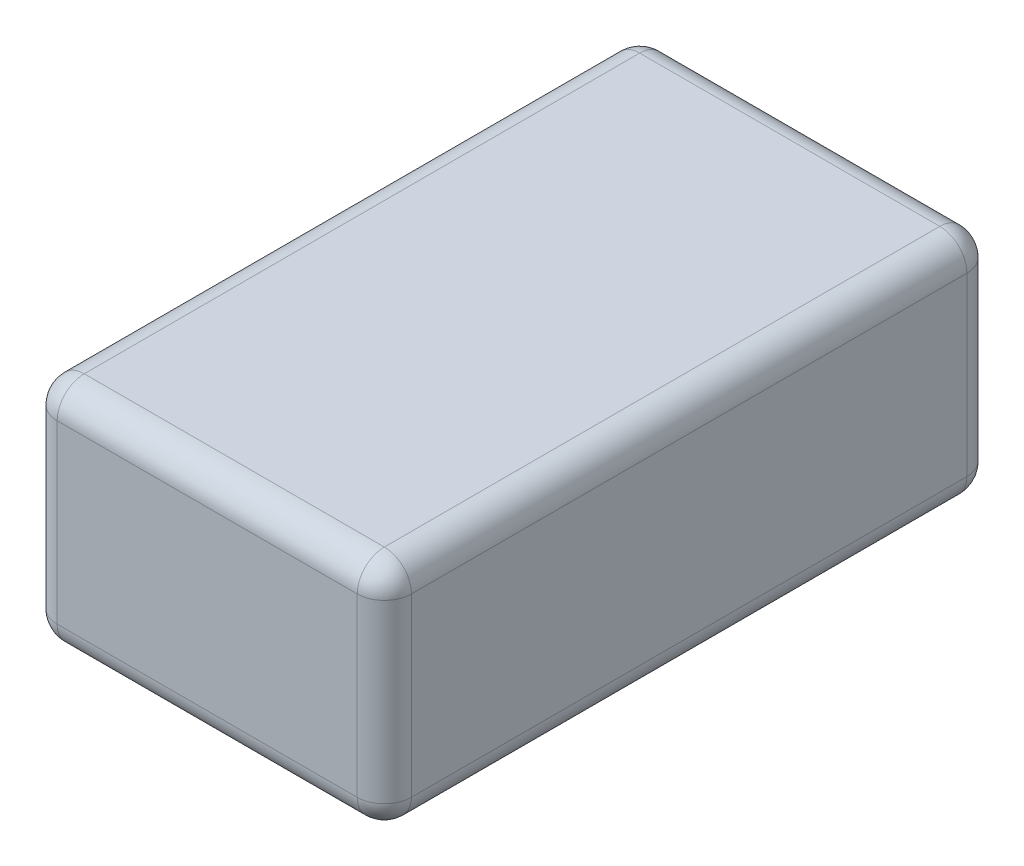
ISO-10303-21;
HEADER;
FILE_DESCRIPTION(('STEP AP214'),'2;1');
FILE_NAME('part.step','',(''),(''),'','','');
FILE_SCHEMA(('AUTOMOTIVE_DESIGN { 1 0 10303 214 1 1 1 1 }'));
ENDSEC;
DATA;
#1=APPLICATION_CONTEXT('core data for automotive mechanical design processes');
#2=APPLICATION_PROTOCOL_DEFINITION('international standard','automotive_design',2000,#1);
#3=PRODUCT_CONTEXT('',#1,'mechanical');
#4=PRODUCT('Part','Part','',(#3));
#5=PRODUCT_RELATED_PRODUCT_CATEGORY('part','',(#4));
#6=PRODUCT_DEFINITION_FORMATION('','',#4);
#7=PRODUCT_DEFINITION_CONTEXT('part definition',#1,'design');
#8=PRODUCT_DEFINITION('design','',#6,#7);
#9=PRODUCT_DEFINITION_SHAPE('','',#8);
#10=(LENGTH_UNIT() NAMED_UNIT(*) SI_UNIT(.MILLI.,.METRE.));
#11=(NAMED_UNIT(*) PLANE_ANGLE_UNIT() SI_UNIT($,.RADIAN.));
#12=(NAMED_UNIT(*) SI_UNIT($,.STERADIAN.) SOLID_ANGLE_UNIT());
#13=UNCERTAINTY_MEASURE_WITH_UNIT(LENGTH_MEASURE(1.E-05),#10,'distance_accuracy_value','');
#14=(GEOMETRIC_REPRESENTATION_CONTEXT(3) GLOBAL_UNCERTAINTY_ASSIGNED_CONTEXT((#13)) GLOBAL_UNIT_ASSIGNED_CONTEXT((#10,
#11,#12)) REPRESENTATION_CONTEXT('',''));
#15=CARTESIAN_POINT('',(0.,0.,0.));
#16=DIRECTION('',(0.,0.,1.));
#17=DIRECTION('',(1.,0.,0.));
#18=AXIS2_PLACEMENT_3D('',#15,#16,#17);
#19=CARTESIAN_POINT('',(13.075,17.,-22.5));
#20=DIRECTION('',(-1.,0.,0.));
#21=DIRECTION('',(0.,0.,1.));
#22=AXIS2_PLACEMENT_3D('',#19,#20,#21);
#23=PLANE('',#22);
#24=DIRECTION('',(0.,0.,-1.));
#25=VECTOR('',#24,1.);
#26=CARTESIAN_POINT('',(13.075,2.,-22.5));
#27=LINE('',#26,#25);
#28=CARTESIAN_POINT('',(13.075,2.,20.5));
#29=VERTEX_POINT('',#28);
#30=CARTESIAN_POINT('',(13.075,2.,-20.5));
#31=VERTEX_POINT('',#30);
#32=EDGE_CURVE('E216',#29,#31,#27,.T.);
#33=ORIENTED_EDGE('',*,*,#32,.T.);
#34=DIRECTION('',(0.,-1.,0.));
#35=VECTOR('',#34,1.);
#36=CARTESIAN_POINT('',(13.075,17.,-20.5));
#37=LINE('',#36,#35);
#38=CARTESIAN_POINT('',(13.075,15.,-20.5));
#39=VERTEX_POINT('',#38);
#40=EDGE_CURVE('E214',#31,#39,#37,.F.);
#41=ORIENTED_EDGE('',*,*,#40,.T.);
#42=DIRECTION('',(0.,0.,-1.));
#43=VECTOR('',#42,1.);
#44=CARTESIAN_POINT('',(13.075,15.,22.5));
#45=LINE('',#44,#43);
#46=CARTESIAN_POINT('',(13.075,15.,20.5));
#47=VERTEX_POINT('',#46);
#48=EDGE_CURVE('E207',#39,#47,#45,.F.);
#49=ORIENTED_EDGE('',*,*,#48,.T.);
#50=DIRECTION('',(0.,-1.,0.));
#51=VECTOR('',#50,1.);
#52=CARTESIAN_POINT('',(13.075,17.,20.5));
#53=LINE('',#52,#51);
#54=EDGE_CURVE('E210',#47,#29,#53,.T.);
#55=ORIENTED_EDGE('',*,*,#54,.T.);
#56=EDGE_LOOP('',(#33,#41,#49,#55));
#57=FACE_BOUND('',#56,.T.);
#58=ADVANCED_FACE('F33',(#57),#23,.F.);
#59=CARTESIAN_POINT('',(-13.075,17.,-22.5));
#60=DIRECTION('',(0.,0.,1.));
#61=DIRECTION('',(1.,0.,0.));
#62=AXIS2_PLACEMENT_3D('',#59,#60,#61);
#63=PLANE('',#62);
#64=CARTESIAN_POINT('',(5.99999999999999,8.5,-22.5));
#65=DIRECTION('',(0.,0.,1.));
#66=DIRECTION('',(1.,0.,0.));
#67=AXIS2_PLACEMENT_3D('',#64,#65,#66);
#68=CIRCLE('',#67,3.);
#69=CARTESIAN_POINT('',(8.99999999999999,8.5,-22.5));
#70=VERTEX_POINT('',#69);
#71=EDGE_CURVE('E309',#70,#70,#68,.T.);
#72=ORIENTED_EDGE('',*,*,#71,.T.);
#73=EDGE_LOOP('',(#72));
#74=FACE_BOUND('',#73,.T.);
#75=CARTESIAN_POINT('',(-6.00000000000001,8.5,-22.5));
#76=DIRECTION('',(0.,0.,1.));
#77=DIRECTION('',(1.,0.,0.));
#78=AXIS2_PLACEMENT_3D('',#75,#76,#77);
#79=CIRCLE('',#78,4.);
#80=CARTESIAN_POINT('',(-2.00000000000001,8.5,-22.5));
#81=VERTEX_POINT('',#80);
#82=EDGE_CURVE('E303',#81,#81,#79,.T.);
#83=ORIENTED_EDGE('',*,*,#82,.T.);
#84=EDGE_LOOP('',(#83));
#85=FACE_BOUND('',#84,.T.);
#86=DIRECTION('',(-1.,0.,0.));
#87=VECTOR('',#86,1.);
#88=CARTESIAN_POINT('',(-13.075,2.,-22.5));
#89=LINE('',#88,#87);
#90=CARTESIAN_POINT('',(11.075,2.,-22.5));
#91=VERTEX_POINT('',#90);
#92=CARTESIAN_POINT('',(-11.075,2.,-22.5));
#93=VERTEX_POINT('',#92);
#94=EDGE_CURVE('E273',#91,#93,#89,.T.);
#95=ORIENTED_EDGE('',*,*,#94,.T.);
#96=DIRECTION('',(0.,-1.,0.));
#97=VECTOR('',#96,1.);
#98=CARTESIAN_POINT('',(-11.075,17.,-22.5));
#99=LINE('',#98,#97);
#100=CARTESIAN_POINT('',(-11.075,15.,-22.5));
#101=VERTEX_POINT('',#100);
#102=EDGE_CURVE('E275',#93,#101,#99,.F.);
#103=ORIENTED_EDGE('',*,*,#102,.T.);
#104=DIRECTION('',(-1.,0.,0.));
#105=VECTOR('',#104,1.);
#106=CARTESIAN_POINT('',(13.075,15.,-22.5));
#107=LINE('',#106,#105);
#108=CARTESIAN_POINT('',(11.075,15.,-22.5));
#109=VERTEX_POINT('',#108);
#110=EDGE_CURVE('E266',#101,#109,#107,.F.);
#111=ORIENTED_EDGE('',*,*,#110,.T.);
#112=DIRECTION('',(0.,-1.,0.));
#113=VECTOR('',#112,1.);
#114=CARTESIAN_POINT('',(11.075,17.,-22.5));
#115=LINE('',#114,#113);
#116=EDGE_CURVE('E268',#109,#91,#115,.T.);
#117=ORIENTED_EDGE('',*,*,#116,.T.);
#118=EDGE_LOOP('',(#95,#103,#111,#117));
#119=FACE_BOUND('',#118,.T.);
#120=ADVANCED_FACE('F327',(#74,#85,#119),#63,.F.);
#121=CARTESIAN_POINT('',(-13.075,17.,-22.5));
#122=DIRECTION('',(1.,0.,0.));
#123=DIRECTION('',(0.,0.,-1.));
#124=AXIS2_PLACEMENT_3D('',#121,#122,#123);
#125=PLANE('',#124);
#126=DIRECTION('',(0.,-1.,0.));
#127=VECTOR('',#126,1.);
#128=CARTESIAN_POINT('',(-13.075,17.,-20.5));
#129=LINE('',#128,#127);
#130=CARTESIAN_POINT('',(-13.075,15.,-20.5));
#131=VERTEX_POINT('',#130);
#132=CARTESIAN_POINT('',(-13.075,2.,-20.5));
#133=VERTEX_POINT('',#132);
#134=EDGE_CURVE('E134',#131,#133,#129,.T.);
#135=ORIENTED_EDGE('',*,*,#134,.T.);
#136=DIRECTION('',(0.,0.,1.));
#137=VECTOR('',#136,1.);
#138=CARTESIAN_POINT('',(-13.075,2.,-22.5));
#139=LINE('',#138,#137);
#140=CARTESIAN_POINT('',(-13.075,2.,20.5));
#141=VERTEX_POINT('',#140);
#142=EDGE_CURVE('E130',#133,#141,#139,.T.);
#143=ORIENTED_EDGE('',*,*,#142,.T.);
#144=DIRECTION('',(0.,-1.,0.));
#145=VECTOR('',#144,1.);
#146=CARTESIAN_POINT('',(-13.075,17.,20.5));
#147=LINE('',#146,#145);
#148=CARTESIAN_POINT('',(-13.075,15.,20.5));
#149=VERTEX_POINT('',#148);
#150=EDGE_CURVE('E125',#141,#149,#147,.F.);
#151=ORIENTED_EDGE('',*,*,#150,.T.);
#152=DIRECTION('',(0.,0.,1.));
#153=VECTOR('',#152,1.);
#154=CARTESIAN_POINT('',(-13.075,15.,-22.5));
#155=LINE('',#154,#153);
#156=EDGE_CURVE('E128',#149,#131,#155,.F.);
#157=ORIENTED_EDGE('',*,*,#156,.T.);
#158=EDGE_LOOP('',(#135,#143,#151,#157));
#159=FACE_BOUND('',#158,.T.);
#160=ADVANCED_FACE('F127',(#159),#125,.F.);
#161=CARTESIAN_POINT('',(-13.075,17.,22.5));
#162=DIRECTION('',(0.,0.,-1.));
#163=DIRECTION('',(-1.,0.,0.));
#164=AXIS2_PLACEMENT_3D('',#161,#162,#163);
#165=PLANE('',#164);
#166=DIRECTION('',(0.,-1.,0.));
#167=VECTOR('',#166,1.);
#168=CARTESIAN_POINT('',(-11.075,17.,22.5));
#169=LINE('',#168,#167);
#170=CARTESIAN_POINT('',(-11.075,15.,22.5));
#171=VERTEX_POINT('',#170);
#172=CARTESIAN_POINT('',(-11.075,2.,22.5));
#173=VERTEX_POINT('',#172);
#174=EDGE_CURVE('E152',#171,#173,#169,.T.);
#175=ORIENTED_EDGE('',*,*,#174,.T.);
#176=DIRECTION('',(1.,0.,0.));
#177=VECTOR('',#176,1.);
#178=CARTESIAN_POINT('',(-13.075,2.,22.5));
#179=LINE('',#178,#177);
#180=CARTESIAN_POINT('',(11.075,2.,22.5));
#181=VERTEX_POINT('',#180);
#182=EDGE_CURVE('E211',#173,#181,#179,.T.);
#183=ORIENTED_EDGE('',*,*,#182,.T.);
#184=DIRECTION('',(0.,-1.,0.));
#185=VECTOR('',#184,1.);
#186=CARTESIAN_POINT('',(11.075,17.,22.5));
#187=LINE('',#186,#185);
#188=CARTESIAN_POINT('',(11.075,15.,22.5));
#189=VERTEX_POINT('',#188);
#190=EDGE_CURVE('E278',#181,#189,#187,.F.);
#191=ORIENTED_EDGE('',*,*,#190,.T.);
#192=DIRECTION('',(1.,0.,0.));
#193=VECTOR('',#192,1.);
#194=CARTESIAN_POINT('',(-13.075,15.,22.5));
#195=LINE('',#194,#193);
#196=EDGE_CURVE('E280',#189,#171,#195,.F.);
#197=ORIENTED_EDGE('',*,*,#196,.T.);
#198=EDGE_LOOP('',(#175,#183,#191,#197));
#199=FACE_BOUND('',#198,.T.);
#200=ADVANCED_FACE('F398',(#199),#165,.F.);
#201=CARTESIAN_POINT('',(0.,17.,0.));
#202=DIRECTION('',(0.,1.,0.));
#203=DIRECTION('',(0.,0.,1.));
#204=AXIS2_PLACEMENT_3D('',#201,#202,#203);
#205=PLANE('',#204);
#206=DIRECTION('',(0.,0.,-1.));
#207=VECTOR('',#206,1.);
#208=CARTESIAN_POINT('',(11.075,17.,-22.5));
#209=LINE('',#208,#207);
#210=CARTESIAN_POINT('',(11.075,17.,20.5));
#211=VERTEX_POINT('',#210);
#212=CARTESIAN_POINT('',(11.075,17.,-20.5));
#213=VERTEX_POINT('',#212);
#214=EDGE_CURVE('E220',#211,#213,#209,.T.);
#215=ORIENTED_EDGE('',*,*,#214,.T.);
#216=DIRECTION('',(-1.,0.,0.));
#217=VECTOR('',#216,1.);
#218=CARTESIAN_POINT('',(-13.075,17.,-20.5));
#219=LINE('',#218,#217);
#220=CARTESIAN_POINT('',(-11.075,17.,-20.5));
#221=VERTEX_POINT('',#220);
#222=EDGE_CURVE('E11',#213,#221,#219,.T.);
#223=ORIENTED_EDGE('',*,*,#222,.T.);
#224=DIRECTION('',(0.,0.,1.));
#225=VECTOR('',#224,1.);
#226=CARTESIAN_POINT('',(-11.075,17.,22.5));
#227=LINE('',#226,#225);
#228=CARTESIAN_POINT('',(-11.075,17.,20.5));
#229=VERTEX_POINT('',#228);
#230=EDGE_CURVE('E42',#221,#229,#227,.T.);
#231=ORIENTED_EDGE('',*,*,#230,.T.);
#232=DIRECTION('',(1.,0.,0.));
#233=VECTOR('',#232,1.);
#234=CARTESIAN_POINT('',(13.075,17.,20.5));
#235=LINE('',#234,#233);
#236=EDGE_CURVE('E222',#229,#211,#235,.T.);
#237=ORIENTED_EDGE('',*,*,#236,.T.);
#238=EDGE_LOOP('',(#215,#223,#231,#237));
#239=FACE_BOUND('',#238,.T.);
#240=ADVANCED_FACE('F393',(#239),#205,.T.);
#241=CARTESIAN_POINT('',(0.,0.,0.));
#242=DIRECTION('',(0.,1.,0.));
#243=DIRECTION('',(0.,0.,1.));
#244=AXIS2_PLACEMENT_3D('',#241,#242,#243);
#245=PLANE('',#244);
#246=DIRECTION('',(1.,0.,0.));
#247=VECTOR('',#246,1.);
#248=CARTESIAN_POINT('',(0.,0.,20.5));
#249=LINE('',#248,#247);
#250=CARTESIAN_POINT('',(11.075,0.,20.5));
#251=VERTEX_POINT('',#250);
#252=CARTESIAN_POINT('',(-11.075,0.,20.5));
#253=VERTEX_POINT('',#252);
#254=EDGE_CURVE('E258',#251,#253,#249,.F.);
#255=ORIENTED_EDGE('',*,*,#254,.T.);
#256=DIRECTION('',(0.,0.,1.));
#257=VECTOR('',#256,1.);
#258=CARTESIAN_POINT('',(-11.075,0.,0.));
#259=LINE('',#258,#257);
#260=CARTESIAN_POINT('',(-11.075,0.,-20.5));
#261=VERTEX_POINT('',#260);
#262=EDGE_CURVE('E257',#253,#261,#259,.F.);
#263=ORIENTED_EDGE('',*,*,#262,.T.);
#264=DIRECTION('',(-1.,0.,0.));
#265=VECTOR('',#264,1.);
#266=CARTESIAN_POINT('',(0.,0.,-20.5));
#267=LINE('',#266,#265);
#268=CARTESIAN_POINT('',(11.075,0.,-20.5));
#269=VERTEX_POINT('',#268);
#270=EDGE_CURVE('E251',#261,#269,#267,.F.);
#271=ORIENTED_EDGE('',*,*,#270,.T.);
#272=DIRECTION('',(0.,0.,-1.));
#273=VECTOR('',#272,1.);
#274=CARTESIAN_POINT('',(11.075,0.,0.));
#275=LINE('',#274,#273);
#276=EDGE_CURVE('E298',#269,#251,#275,.F.);
#277=ORIENTED_EDGE('',*,*,#276,.T.);
#278=EDGE_LOOP('',(#255,#263,#271,#277));
#279=FACE_BOUND('',#278,.T.);
#280=ADVANCED_FACE('F261',(#279),#245,.F.);
#281=CARTESIAN_POINT('',(11.075,15.,0.));
#282=DIRECTION('',(0.,0.,1.));
#283=DIRECTION('',(1.,0.,0.));
#284=AXIS2_PLACEMENT_3D('',#281,#282,#283);
#285=CYLINDRICAL_SURFACE('',#284,2.);
#286=CARTESIAN_POINT('',(11.075,15.,-20.5));
#287=DIRECTION('',(0.,0.,-1.));
#288=DIRECTION('',(-1.,0.,0.));
#289=AXIS2_PLACEMENT_3D('',#286,#287,#288);
#290=CIRCLE('',#289,2.);
#291=EDGE_CURVE('E37',#213,#39,#290,.T.);
#292=ORIENTED_EDGE('',*,*,#291,.F.);
#293=ORIENTED_EDGE('',*,*,#214,.F.);
#294=CARTESIAN_POINT('',(11.075,15.,20.5));
#295=DIRECTION('',(0.,0.,1.));
#296=DIRECTION('',(1.,0.,0.));
#297=AXIS2_PLACEMENT_3D('',#294,#295,#296);
#298=CIRCLE('',#297,2.);
#299=EDGE_CURVE('E190',#47,#211,#298,.T.);
#300=ORIENTED_EDGE('',*,*,#299,.F.);
#301=ORIENTED_EDGE('',*,*,#48,.F.);
#302=EDGE_LOOP('',(#292,#293,#300,#301));
#303=FACE_BOUND('',#302,.T.);
#304=ADVANCED_FACE('F35',(#303),#285,.T.);
#305=CARTESIAN_POINT('',(11.075,15.,-20.5));
#306=DIRECTION('',(0.,0.,1.));
#307=DIRECTION('',(1.,0.,0.));
#308=AXIS2_PLACEMENT_3D('',#305,#306,#307);
#309=SPHERICAL_SURFACE('',#308,2.);
#310=CARTESIAN_POINT('',(11.075,15.,-20.5));
#311=DIRECTION('',(1.,0.,0.));
#312=DIRECTION('',(0.,1.,0.));
#313=AXIS2_PLACEMENT_3D('',#310,#311,#312);
#314=CIRCLE('',#313,2.);
#315=EDGE_CURVE('E186',#213,#109,#314,.F.);
#316=ORIENTED_EDGE('',*,*,#315,.F.);
#317=ORIENTED_EDGE('',*,*,#291,.T.);
#318=CARTESIAN_POINT('',(11.075,15.,-20.5));
#319=DIRECTION('',(0.,1.,0.));
#320=DIRECTION('',(0.,0.,1.));
#321=AXIS2_PLACEMENT_3D('',#318,#319,#320);
#322=CIRCLE('',#321,2.);
#323=EDGE_CURVE('E189',#109,#39,#322,.F.);
#324=ORIENTED_EDGE('',*,*,#323,.F.);
#325=EDGE_LOOP('',(#316,#317,#324));
#326=FACE_BOUND('',#325,.T.);
#327=ADVANCED_FACE('F202',(#326),#309,.T.);
#328=CARTESIAN_POINT('',(11.075,15.,20.5));
#329=DIRECTION('',(0.,0.,1.));
#330=DIRECTION('',(1.,0.,0.));
#331=AXIS2_PLACEMENT_3D('',#328,#329,#330);
#332=SPHERICAL_SURFACE('',#331,2.);
#333=CARTESIAN_POINT('',(11.075,15.,20.5));
#334=DIRECTION('',(0.,1.,0.));
#335=DIRECTION('',(0.,0.,1.));
#336=AXIS2_PLACEMENT_3D('',#333,#334,#335);
#337=CIRCLE('',#336,2.);
#338=EDGE_CURVE('E180',#47,#189,#337,.F.);
#339=ORIENTED_EDGE('',*,*,#338,.F.);
#340=ORIENTED_EDGE('',*,*,#299,.T.);
#341=CARTESIAN_POINT('',(11.075,15.,20.5));
#342=DIRECTION('',(1.,0.,0.));
#343=DIRECTION('',(0.,0.,-1.));
#344=AXIS2_PLACEMENT_3D('',#341,#342,#343);
#345=CIRCLE('',#344,2.);
#346=EDGE_CURVE('E183',#189,#211,#345,.F.);
#347=ORIENTED_EDGE('',*,*,#346,.F.);
#348=EDGE_LOOP('',(#339,#340,#347));
#349=FACE_BOUND('',#348,.T.);
#350=ADVANCED_FACE('F384',(#349),#332,.T.);
#351=CARTESIAN_POINT('',(11.075,17.,-20.5));
#352=DIRECTION('',(0.,-1.,0.));
#353=DIRECTION('',(0.,0.,-1.));
#354=AXIS2_PLACEMENT_3D('',#351,#352,#353);
#355=CYLINDRICAL_SURFACE('',#354,2.);
#356=ORIENTED_EDGE('',*,*,#323,.T.);
#357=ORIENTED_EDGE('',*,*,#40,.F.);
#358=CARTESIAN_POINT('',(11.075,2.,-20.5));
#359=DIRECTION('',(0.,-1.,0.));
#360=DIRECTION('',(0.,0.,-1.));
#361=AXIS2_PLACEMENT_3D('',#358,#359,#360);
#362=CIRCLE('',#361,2.);
#363=EDGE_CURVE('E174',#91,#31,#362,.T.);
#364=ORIENTED_EDGE('',*,*,#363,.F.);
#365=ORIENTED_EDGE('',*,*,#116,.F.);
#366=EDGE_LOOP('',(#356,#357,#364,#365));
#367=FACE_BOUND('',#366,.T.);
#368=ADVANCED_FACE('F380',(#367),#355,.T.);
#369=CARTESIAN_POINT('',(0.,15.,-20.5));
#370=DIRECTION('',(1.,0.,0.));
#371=DIRECTION('',(0.,0.,-1.));
#372=AXIS2_PLACEMENT_3D('',#369,#370,#371);
#373=CYLINDRICAL_SURFACE('',#372,2.);
#374=ORIENTED_EDGE('',*,*,#315,.T.);
#375=ORIENTED_EDGE('',*,*,#110,.F.);
#376=CARTESIAN_POINT('',(-11.075,15.,-20.5));
#377=DIRECTION('',(-1.,0.,0.));
#378=DIRECTION('',(0.,0.,1.));
#379=AXIS2_PLACEMENT_3D('',#376,#377,#378);
#380=CIRCLE('',#379,2.);
#381=EDGE_CURVE('E172',#221,#101,#380,.T.);
#382=ORIENTED_EDGE('',*,*,#381,.F.);
#383=ORIENTED_EDGE('',*,*,#222,.F.);
#384=EDGE_LOOP('',(#374,#375,#382,#383));
#385=FACE_BOUND('',#384,.T.);
#386=ADVANCED_FACE('F377',(#385),#373,.T.);
#387=CARTESIAN_POINT('',(-11.075,15.,0.));
#388=DIRECTION('',(0.,0.,-1.));
#389=DIRECTION('',(-1.,0.,0.));
#390=AXIS2_PLACEMENT_3D('',#387,#388,#389);
#391=CYLINDRICAL_SURFACE('',#390,2.);
#392=CARTESIAN_POINT('',(-11.075,15.,20.5));
#393=DIRECTION('',(0.,0.,1.));
#394=DIRECTION('',(1.,0.,0.));
#395=AXIS2_PLACEMENT_3D('',#392,#393,#394);
#396=CIRCLE('',#395,2.);
#397=EDGE_CURVE('E140',#229,#149,#396,.T.);
#398=ORIENTED_EDGE('',*,*,#397,.F.);
#399=ORIENTED_EDGE('',*,*,#230,.F.);
#400=CARTESIAN_POINT('',(-11.075,15.,-20.5));
#401=DIRECTION('',(0.,0.,-1.));
#402=DIRECTION('',(-1.,0.,0.));
#403=AXIS2_PLACEMENT_3D('',#400,#401,#402);
#404=CIRCLE('',#403,2.);
#405=EDGE_CURVE('E50',#131,#221,#404,.T.);
#406=ORIENTED_EDGE('',*,*,#405,.F.);
#407=ORIENTED_EDGE('',*,*,#156,.F.);
#408=EDGE_LOOP('',(#398,#399,#406,#407));
#409=FACE_BOUND('',#408,.T.);
#410=ADVANCED_FACE('F139',(#409),#391,.T.);
#411=CARTESIAN_POINT('',(0.,15.,20.5));
#412=DIRECTION('',(-1.,0.,0.));
#413=DIRECTION('',(0.,0.,1.));
#414=AXIS2_PLACEMENT_3D('',#411,#412,#413);
#415=CYLINDRICAL_SURFACE('',#414,2.);
#416=ORIENTED_EDGE('',*,*,#346,.T.);
#417=ORIENTED_EDGE('',*,*,#236,.F.);
#418=CARTESIAN_POINT('',(-11.075,15.,20.5));
#419=DIRECTION('',(-1.,0.,0.));
#420=DIRECTION('',(0.,0.,1.));
#421=AXIS2_PLACEMENT_3D('',#418,#419,#420);
#422=CIRCLE('',#421,2.);
#423=EDGE_CURVE('E149',#171,#229,#422,.T.);
#424=ORIENTED_EDGE('',*,*,#423,.F.);
#425=ORIENTED_EDGE('',*,*,#196,.F.);
#426=EDGE_LOOP('',(#416,#417,#424,#425));
#427=FACE_BOUND('',#426,.T.);
#428=ADVANCED_FACE('F371',(#427),#415,.T.);
#429=CARTESIAN_POINT('',(11.075,17.,20.5));
#430=DIRECTION('',(0.,-1.,0.));
#431=DIRECTION('',(0.,0.,-1.));
#432=AXIS2_PLACEMENT_3D('',#429,#430,#431);
#433=CYLINDRICAL_SURFACE('',#432,2.);
#434=ORIENTED_EDGE('',*,*,#338,.T.);
#435=ORIENTED_EDGE('',*,*,#190,.F.);
#436=CARTESIAN_POINT('',(11.075,2.,20.5));
#437=DIRECTION('',(0.,-1.,0.));
#438=DIRECTION('',(0.,0.,-1.));
#439=AXIS2_PLACEMENT_3D('',#436,#437,#438);
#440=CIRCLE('',#439,2.);
#441=EDGE_CURVE('E167',#29,#181,#440,.T.);
#442=ORIENTED_EDGE('',*,*,#441,.F.);
#443=ORIENTED_EDGE('',*,*,#54,.F.);
#444=EDGE_LOOP('',(#434,#435,#442,#443));
#445=FACE_BOUND('',#444,.T.);
#446=ADVANCED_FACE('F292',(#445),#433,.T.);
#447=CARTESIAN_POINT('',(11.075,2.,-22.5));
#448=DIRECTION('',(0.,0.,-1.));
#449=DIRECTION('',(-1.,0.,0.));
#450=AXIS2_PLACEMENT_3D('',#447,#448,#449);
#451=CYLINDRICAL_SURFACE('',#450,2.);
#452=CARTESIAN_POINT('',(11.075,2.,-20.5));
#453=DIRECTION('',(0.,0.,-1.));
#454=DIRECTION('',(-1.,0.,0.));
#455=AXIS2_PLACEMENT_3D('',#452,#453,#454);
#456=CIRCLE('',#455,2.);
#457=EDGE_CURVE('E177',#31,#269,#456,.T.);
#458=ORIENTED_EDGE('',*,*,#457,.F.);
#459=ORIENTED_EDGE('',*,*,#32,.F.);
#460=CARTESIAN_POINT('',(11.075,2.,20.5));
#461=DIRECTION('',(0.,0.,1.));
#462=DIRECTION('',(1.,0.,0.));
#463=AXIS2_PLACEMENT_3D('',#460,#461,#462);
#464=CIRCLE('',#463,2.);
#465=EDGE_CURVE('E164',#251,#29,#464,.T.);
#466=ORIENTED_EDGE('',*,*,#465,.F.);
#467=ORIENTED_EDGE('',*,*,#276,.F.);
#468=EDGE_LOOP('',(#458,#459,#466,#467));
#469=FACE_BOUND('',#468,.T.);
#470=ADVANCED_FACE('F289',(#469),#451,.T.);
#471=CARTESIAN_POINT('',(11.075,2.,-20.5));
#472=DIRECTION('',(0.,0.,1.));
#473=DIRECTION('',(1.,0.,0.));
#474=AXIS2_PLACEMENT_3D('',#471,#472,#473);
#475=SPHERICAL_SURFACE('',#474,2.);
#476=ORIENTED_EDGE('',*,*,#363,.T.);
#477=ORIENTED_EDGE('',*,*,#457,.T.);
#478=CARTESIAN_POINT('',(11.075,2.,-20.5));
#479=DIRECTION('',(1.,0.,0.));
#480=DIRECTION('',(0.,0.,-1.));
#481=AXIS2_PLACEMENT_3D('',#478,#479,#480);
#482=CIRCLE('',#481,2.);
#483=EDGE_CURVE('E156',#91,#269,#482,.F.);
#484=ORIENTED_EDGE('',*,*,#483,.F.);
#485=EDGE_LOOP('',(#476,#477,#484));
#486=FACE_BOUND('',#485,.T.);
#487=ADVANCED_FACE('F363',(#486),#475,.T.);
#488=CARTESIAN_POINT('',(-11.075,15.,-20.5));
#489=DIRECTION('',(0.,0.,1.));
#490=DIRECTION('',(1.,0.,0.));
#491=AXIS2_PLACEMENT_3D('',#488,#489,#490);
#492=SPHERICAL_SURFACE('',#491,2.);
#493=ORIENTED_EDGE('',*,*,#405,.T.);
#494=ORIENTED_EDGE('',*,*,#381,.T.);
#495=CARTESIAN_POINT('',(-11.075,15.,-20.5));
#496=DIRECTION('',(0.,1.,0.));
#497=DIRECTION('',(0.,0.,1.));
#498=AXIS2_PLACEMENT_3D('',#495,#496,#497);
#499=CIRCLE('',#498,2.);
#500=EDGE_CURVE('E153',#131,#101,#499,.F.);
#501=ORIENTED_EDGE('',*,*,#500,.F.);
#502=EDGE_LOOP('',(#493,#494,#501));
#503=FACE_BOUND('',#502,.T.);
#504=ADVANCED_FACE('F360',(#503),#492,.T.);
#505=CARTESIAN_POINT('',(-11.075,15.,20.5));
#506=DIRECTION('',(0.,0.,1.));
#507=DIRECTION('',(1.,0.,0.));
#508=AXIS2_PLACEMENT_3D('',#505,#506,#507);
#509=SPHERICAL_SURFACE('',#508,2.);
#510=ORIENTED_EDGE('',*,*,#423,.T.);
#511=ORIENTED_EDGE('',*,*,#397,.T.);
#512=CARTESIAN_POINT('',(-11.075,15.,20.5));
#513=DIRECTION('',(0.,1.,0.));
#514=DIRECTION('',(0.,0.,1.));
#515=AXIS2_PLACEMENT_3D('',#512,#513,#514);
#516=CIRCLE('',#515,2.);
#517=EDGE_CURVE('E146',#171,#149,#516,.F.);
#518=ORIENTED_EDGE('',*,*,#517,.F.);
#519=EDGE_LOOP('',(#510,#511,#518));
#520=FACE_BOUND('',#519,.T.);
#521=ADVANCED_FACE('F145',(#520),#509,.T.);
#522=CARTESIAN_POINT('',(11.075,2.,20.5));
#523=DIRECTION('',(0.,0.,1.));
#524=DIRECTION('',(1.,0.,0.));
#525=AXIS2_PLACEMENT_3D('',#522,#523,#524);
#526=SPHERICAL_SURFACE('',#525,2.);
#527=ORIENTED_EDGE('',*,*,#465,.T.);
#528=ORIENTED_EDGE('',*,*,#441,.T.);
#529=CARTESIAN_POINT('',(11.075,2.,20.5));
#530=DIRECTION('',(1.,0.,0.));
#531=DIRECTION('',(0.,0.,-1.));
#532=AXIS2_PLACEMENT_3D('',#529,#530,#531);
#533=CIRCLE('',#532,2.);
#534=EDGE_CURVE('E154',#251,#181,#533,.F.);
#535=ORIENTED_EDGE('',*,*,#534,.F.);
#536=EDGE_LOOP('',(#527,#528,#535));
#537=FACE_BOUND('',#536,.T.);
#538=ADVANCED_FACE('F294',(#537),#526,.T.);
#539=CARTESIAN_POINT('',(-13.075,2.,-20.5));
#540=DIRECTION('',(-1.,0.,0.));
#541=DIRECTION('',(0.,0.,1.));
#542=AXIS2_PLACEMENT_3D('',#539,#540,#541);
#543=CYLINDRICAL_SURFACE('',#542,2.);
#544=ORIENTED_EDGE('',*,*,#483,.T.);
#545=ORIENTED_EDGE('',*,*,#270,.F.);
#546=CARTESIAN_POINT('',(-11.075,2.,-20.5));
#547=DIRECTION('',(-1.,0.,0.));
#548=DIRECTION('',(0.,0.,1.));
#549=AXIS2_PLACEMENT_3D('',#546,#547,#548);
#550=CIRCLE('',#549,2.);
#551=EDGE_CURVE('E158',#93,#261,#550,.T.);
#552=ORIENTED_EDGE('',*,*,#551,.F.);
#553=ORIENTED_EDGE('',*,*,#94,.F.);
#554=EDGE_LOOP('',(#544,#545,#552,#553));
#555=FACE_BOUND('',#554,.T.);
#556=ADVANCED_FACE('F253',(#555),#543,.T.);
#557=CARTESIAN_POINT('',(-11.075,17.,-20.5));
#558=DIRECTION('',(0.,-1.,0.));
#559=DIRECTION('',(0.,0.,-1.));
#560=AXIS2_PLACEMENT_3D('',#557,#558,#559);
#561=CYLINDRICAL_SURFACE('',#560,2.);
#562=ORIENTED_EDGE('',*,*,#500,.T.);
#563=ORIENTED_EDGE('',*,*,#102,.F.);
#564=CARTESIAN_POINT('',(-11.075,2.,-20.5));
#565=DIRECTION('',(0.,-1.,0.));
#566=DIRECTION('',(0.,0.,-1.));
#567=AXIS2_PLACEMENT_3D('',#564,#565,#566);
#568=CIRCLE('',#567,2.);
#569=EDGE_CURVE('E240',#133,#93,#568,.T.);
#570=ORIENTED_EDGE('',*,*,#569,.F.);
#571=ORIENTED_EDGE('',*,*,#134,.F.);
#572=EDGE_LOOP('',(#562,#563,#570,#571));
#573=FACE_BOUND('',#572,.T.);
#574=ADVANCED_FACE('F350',(#573),#561,.T.);
#575=CARTESIAN_POINT('',(-11.075,17.,20.5));
#576=DIRECTION('',(0.,-1.,0.));
#577=DIRECTION('',(0.,0.,-1.));
#578=AXIS2_PLACEMENT_3D('',#575,#576,#577);
#579=CYLINDRICAL_SURFACE('',#578,2.);
#580=ORIENTED_EDGE('',*,*,#517,.T.);
#581=ORIENTED_EDGE('',*,*,#150,.F.);
#582=CARTESIAN_POINT('',(-11.075,2.,20.5));
#583=DIRECTION('',(0.,-1.,0.));
#584=DIRECTION('',(0.,0.,-1.));
#585=AXIS2_PLACEMENT_3D('',#582,#583,#584);
#586=CIRCLE('',#585,2.);
#587=EDGE_CURVE('E237',#173,#141,#586,.T.);
#588=ORIENTED_EDGE('',*,*,#587,.F.);
#589=ORIENTED_EDGE('',*,*,#174,.F.);
#590=EDGE_LOOP('',(#580,#581,#588,#589));
#591=FACE_BOUND('',#590,.T.);
#592=ADVANCED_FACE('F151',(#591),#579,.T.);
#593=CARTESIAN_POINT('',(-13.075,2.,20.5));
#594=DIRECTION('',(1.,0.,0.));
#595=DIRECTION('',(0.,0.,-1.));
#596=AXIS2_PLACEMENT_3D('',#593,#594,#595);
#597=CYLINDRICAL_SURFACE('',#596,2.);
#598=ORIENTED_EDGE('',*,*,#534,.T.);
#599=ORIENTED_EDGE('',*,*,#182,.F.);
#600=CARTESIAN_POINT('',(-11.075,2.,20.5));
#601=DIRECTION('',(-1.,0.,0.));
#602=DIRECTION('',(0.,0.,1.));
#603=AXIS2_PLACEMENT_3D('',#600,#601,#602);
#604=CIRCLE('',#603,2.);
#605=EDGE_CURVE('E234',#253,#173,#604,.T.);
#606=ORIENTED_EDGE('',*,*,#605,.F.);
#607=ORIENTED_EDGE('',*,*,#254,.F.);
#608=EDGE_LOOP('',(#598,#599,#606,#607));
#609=FACE_BOUND('',#608,.T.);
#610=ADVANCED_FACE('F297',(#609),#597,.T.);
#611=CARTESIAN_POINT('',(-11.075,2.,-20.5));
#612=DIRECTION('',(0.,0.,1.));
#613=DIRECTION('',(1.,0.,0.));
#614=AXIS2_PLACEMENT_3D('',#611,#612,#613);
#615=SPHERICAL_SURFACE('',#614,2.);
#616=ORIENTED_EDGE('',*,*,#569,.T.);
#617=ORIENTED_EDGE('',*,*,#551,.T.);
#618=CARTESIAN_POINT('',(-11.075,2.,-20.5));
#619=DIRECTION('',(0.,0.,-1.));
#620=DIRECTION('',(-1.,0.,0.));
#621=AXIS2_PLACEMENT_3D('',#618,#619,#620);
#622=CIRCLE('',#621,2.);
#623=EDGE_CURVE('E231',#133,#261,#622,.F.);
#624=ORIENTED_EDGE('',*,*,#623,.F.);
#625=EDGE_LOOP('',(#616,#617,#624));
#626=FACE_BOUND('',#625,.T.);
#627=ADVANCED_FACE('F247',(#626),#615,.T.);
#628=CARTESIAN_POINT('',(-11.075,2.,20.5));
#629=DIRECTION('',(0.,0.,1.));
#630=DIRECTION('',(1.,0.,0.));
#631=AXIS2_PLACEMENT_3D('',#628,#629,#630);
#632=SPHERICAL_SURFACE('',#631,2.);
#633=ORIENTED_EDGE('',*,*,#605,.T.);
#634=ORIENTED_EDGE('',*,*,#587,.T.);
#635=CARTESIAN_POINT('',(-11.075,2.,20.5));
#636=DIRECTION('',(0.,0.,1.));
#637=DIRECTION('',(1.,0.,0.));
#638=AXIS2_PLACEMENT_3D('',#635,#636,#637);
#639=CIRCLE('',#638,2.);
#640=EDGE_CURVE('E229',#253,#141,#639,.F.);
#641=ORIENTED_EDGE('',*,*,#640,.F.);
#642=EDGE_LOOP('',(#633,#634,#641));
#643=FACE_BOUND('',#642,.T.);
#644=ADVANCED_FACE('F340',(#643),#632,.T.);
#645=CARTESIAN_POINT('',(-11.075,2.,-22.5));
#646=DIRECTION('',(0.,0.,1.));
#647=DIRECTION('',(1.,0.,0.));
#648=AXIS2_PLACEMENT_3D('',#645,#646,#647);
#649=CYLINDRICAL_SURFACE('',#648,2.);
#650=ORIENTED_EDGE('',*,*,#623,.T.);
#651=ORIENTED_EDGE('',*,*,#262,.F.);
#652=ORIENTED_EDGE('',*,*,#640,.T.);
#653=ORIENTED_EDGE('',*,*,#142,.F.);
#654=EDGE_LOOP('',(#650,#651,#652,#653));
#655=FACE_BOUND('',#654,.T.);
#656=ADVANCED_FACE('F336',(#655),#649,.T.);
#657=CARTESIAN_POINT('',(-6.00000000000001,8.5,-25.3));
#658=DIRECTION('',(0.,0.,1.));
#659=DIRECTION('',(1.,0.,0.));
#660=AXIS2_PLACEMENT_3D('',#657,#658,#659);
#661=CYLINDRICAL_SURFACE('',#660,4.);
#662=CARTESIAN_POINT('',(-6.00000000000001,8.5,-25.3));
#663=DIRECTION('',(0.,0.,1.));
#664=DIRECTION('',(1.,0.,0.));
#665=AXIS2_PLACEMENT_3D('',#662,#663,#664);
#666=CIRCLE('',#665,4.);
#667=CARTESIAN_POINT('',(-2.00000000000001,8.5,-25.3));
#668=VERTEX_POINT('',#667);
#669=EDGE_CURVE('E232',#668,#668,#666,.T.);
#670=ORIENTED_EDGE('',*,*,#669,.T.);
#671=EDGE_LOOP('',(#670));
#672=FACE_BOUND('',#671,.T.);
#673=ORIENTED_EDGE('',*,*,#82,.F.);
#674=EDGE_LOOP('',(#673));
#675=FACE_BOUND('',#674,.T.);
#676=ADVANCED_FACE('F339',(#672,#675),#661,.T.);
#677=CARTESIAN_POINT('',(-6.00000000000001,8.5,-25.3));
#678=DIRECTION('',(0.,0.,1.));
#679=DIRECTION('',(1.,0.,0.));
#680=AXIS2_PLACEMENT_3D('',#677,#678,#679);
#681=PLANE('',#680);
#682=ORIENTED_EDGE('',*,*,#669,.F.);
#683=EDGE_LOOP('',(#682));
#684=FACE_BOUND('',#683,.T.);
#685=ADVANCED_FACE('F324',(#684),#681,.F.);
#686=CARTESIAN_POINT('',(5.99999999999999,8.5,-25.3));
#687=DIRECTION('',(0.,0.,1.));
#688=DIRECTION('',(1.,0.,0.));
#689=AXIS2_PLACEMENT_3D('',#686,#687,#688);
#690=CYLINDRICAL_SURFACE('',#689,3.);
#691=CARTESIAN_POINT('',(5.99999999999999,8.5,-25.3));
#692=DIRECTION('',(0.,0.,1.));
#693=DIRECTION('',(1.,0.,0.));
#694=AXIS2_PLACEMENT_3D('',#691,#692,#693);
#695=CIRCLE('',#694,3.);
#696=CARTESIAN_POINT('',(8.99999999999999,8.5,-25.3));
#697=VERTEX_POINT('',#696);
#698=EDGE_CURVE('E306',#697,#697,#695,.T.);
#699=ORIENTED_EDGE('',*,*,#698,.T.);
#700=EDGE_LOOP('',(#699));
#701=FACE_BOUND('',#700,.T.);
#702=ORIENTED_EDGE('',*,*,#71,.F.);
#703=EDGE_LOOP('',(#702));
#704=FACE_BOUND('',#703,.T.);
#705=ADVANCED_FACE('F315',(#701,#704),#690,.T.);
#706=CARTESIAN_POINT('',(5.99999999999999,8.5,-25.3));
#707=DIRECTION('',(0.,0.,1.));
#708=DIRECTION('',(1.,0.,0.));
#709=AXIS2_PLACEMENT_3D('',#706,#707,#708);
#710=PLANE('',#709);
#711=ORIENTED_EDGE('',*,*,#698,.F.);
#712=EDGE_LOOP('',(#711));
#713=FACE_BOUND('',#712,.T.);
#714=ADVANCED_FACE('F318',(#713),#710,.F.);
#715=CLOSED_SHELL('',(#58,#120,#160,#200,#240,#280,#304,#327,#350,#368,#386,#410,#428,#446,#470,
#487,#504,#521,#538,#556,#574,#592,#610,#627,#644,#656,#676,#685,#705,#714));
#716=MANIFOLD_SOLID_BREP('B2',#715);
#717=ADVANCED_BREP_SHAPE_REPRESENTATION('',(#18,#716),#14);
#718=SHAPE_DEFINITION_REPRESENTATION(#9,#717);
ENDSEC;
END-ISO-10303-21;
